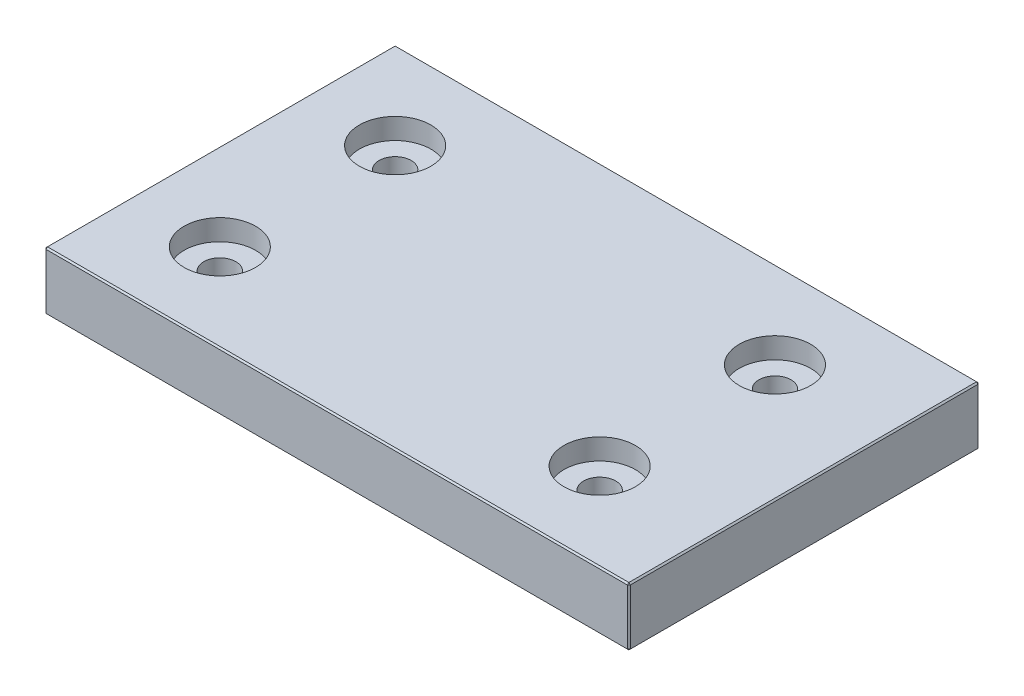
from build123d import *

# Parameters (mm, degrees)
SKETCH1_W                               = 100
SKETCH1_H                               = 60
BOSS_EXTRUDE1_DEPTH                     = 10
CHAMFER1_SIZE                           = 0.25
CBORE_FOR_M5_HEX_HEAD_BOLT1_D           = 5.5
CBORE_FOR_M5_HEX_HEAD_BOLT1_CBORE_D     = 12.24
CBORE_FOR_M5_HEX_HEAD_BOLT1_CBORE_DEPTH = 3.58
LPATTERN1_COUNT                         = 2
LPATTERN1_PITCH                         = 65
LPATTERN1_COUNT_DIR2                    = 2
LPATTERN1_PITCH_DIR2                    = 30


with BuildPart() as part:
    # Sketch1 → Boss-Extrude1 (new body)
    with BuildSketch(Plane(origin=(0, 0, 0), x_dir=(1, 0, 0), z_dir=(0, 1, 0))):
        Rectangle(SKETCH1_W, SKETCH1_H)
    extrude(amount=BOSS_EXTRUDE1_DEPTH)

    # Chamfer1
    chamfer1_edges = [part.edges().sort_by_distance(p)[0] for p in [
        (-50, 10, 0),
        (0, 10, 30),
        (50, 10, 0),
        (0, 0, 30),
        (-50, 0, 0),
        (0, 0, -30),
        (50, 0, 0),
        (0, 10, -30),
        (50, 5, 30),
        (-50, 5, 30),
        (-50, 5, -30),
        (50, 5, -30),
    ]]
    chamfer(chamfer1_edges, length=CHAMFER1_SIZE)

    # CBORE for M5 Hex Head Bolt1 (through all)
    with Locations(Plane(origin=(0, 10, 0), x_dir=(-1, 0, 0), z_dir=(0, 1, 0))):
        with Locations((35, 15)):
            cbore_for_m5_hex_head_bolt1 = CounterBoreHole(CBORE_FOR_M5_HEX_HEAD_BOLT1_D / 2, CBORE_FOR_M5_HEX_HEAD_BOLT1_CBORE_D / 2, CBORE_FOR_M5_HEX_HEAD_BOLT1_CBORE_DEPTH)

    # LPattern1: CBORE for M5 Hex Head Bolt1 2 × 2
    with Locations(*[(i * LPATTERN1_PITCH, 0, -j * LPATTERN1_PITCH_DIR2) for i in range(LPATTERN1_COUNT) for j in range(LPATTERN1_COUNT_DIR2) if (i, j) != (0, 0)]):
        add(cbore_for_m5_hex_head_bolt1, mode=Mode.SUBTRACT)


solid = part.part
